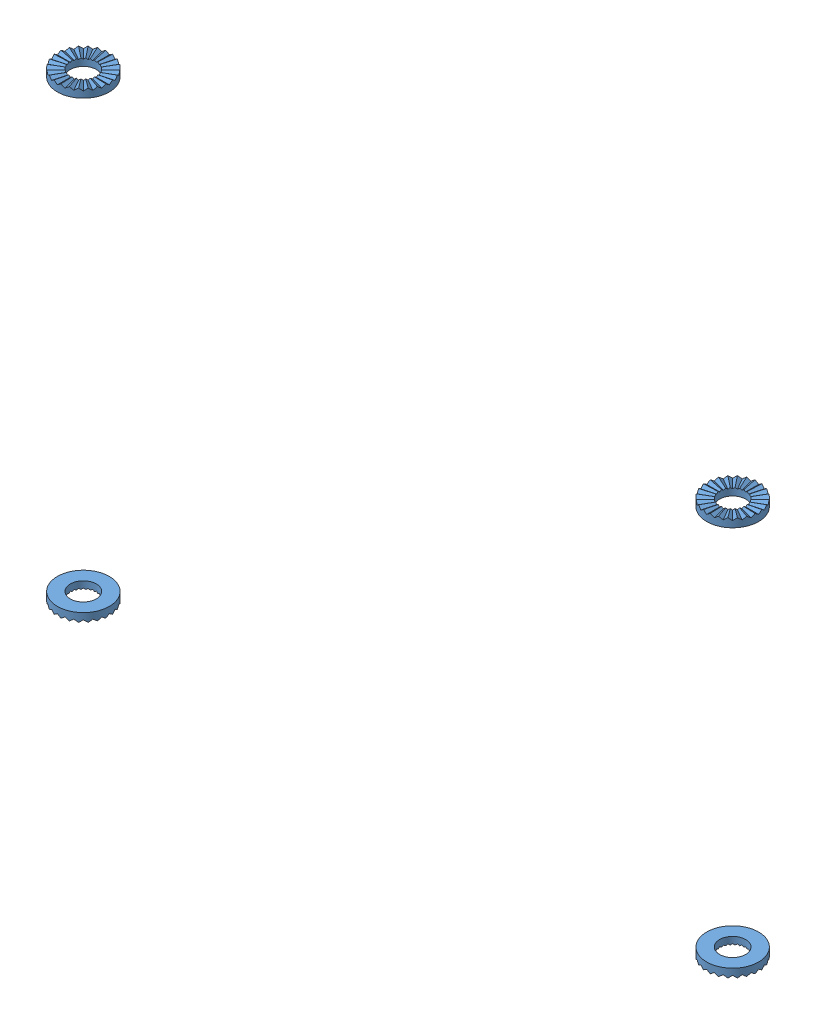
SolidWorks assembly Assemblage pour stries.SLDASM, configuration Default (file format 3800). Lengths in mm.
Overall size (162 106.91 12).
4 component instances, 1 part files, 9 mates.
Components (placement in the parent):
- Stries complémentaires à celles rondelle spéciale-1: Stries complémentaires à celles rondelle spéciale.SLDPRT [Default] at (-83 50.4969 -12) x (1 0 0) z (0 -1 0) size (12 12 2)
- Stries complémentaires à celles rondelle spéciale-2: Stries complémentaires à celles rondelle spéciale.SLDPRT [Default] at (-83 -50.4969 -12) x (-1 0 0) z (0 1 0) size (12 12 2)
- Stries complémentaires à celles rondelle spéciale-3: Stries complémentaires à celles rondelle spéciale.SLDPRT [Default] at (-233 61.4469 -12) x (1 0 0) z (0 -1 0) size (12 12 2)
- Stries complémentaires à celles rondelle spéciale-4: Stries complémentaires à celles rondelle spéciale.SLDPRT [Default] at (-233 -54.3569 -12) x (1 0 0) z (0 1 0) size (12 12 2)
Mates (geometry in assembly coordinates):
- Distance1: distance = 44.05 mm anti-aligned: plane of Stries complémentaires à celles rondelle spéciale-1 through (-83 44.05 -12) normal (0 -1 0)
- Distance2: distance = 12 mm aligned: unknown of Stries complémentaires à celles rondelle spéciale-1
- Distance3: distance = 83 mm aligned: unknown of Stries complémentaires à celles rondelle spéciale-1
- Distance4: distance = 55 mm anti-aligned: unknown of Stries complémentaires à celles rondelle spéciale-3
- Distance5: distance = 12 mm aligned: unknown of Stries complémentaires à celles rondelle spéciale-3
- Distance6: distance = 233 mm aligned: unknown of Stries complémentaires à celles rondelle spéciale-3
- Distance7: distance = 47.91 mm aligned: unknown of Stries complémentaires à celles rondelle spéciale-4
- Distance8: distance = 233 mm aligned: unknown of Stries complémentaires à celles rondelle spéciale-4
- Distance9: distance = 12 mm anti-aligned: unknown of Stries complémentaires à celles rondelle spéciale-4
